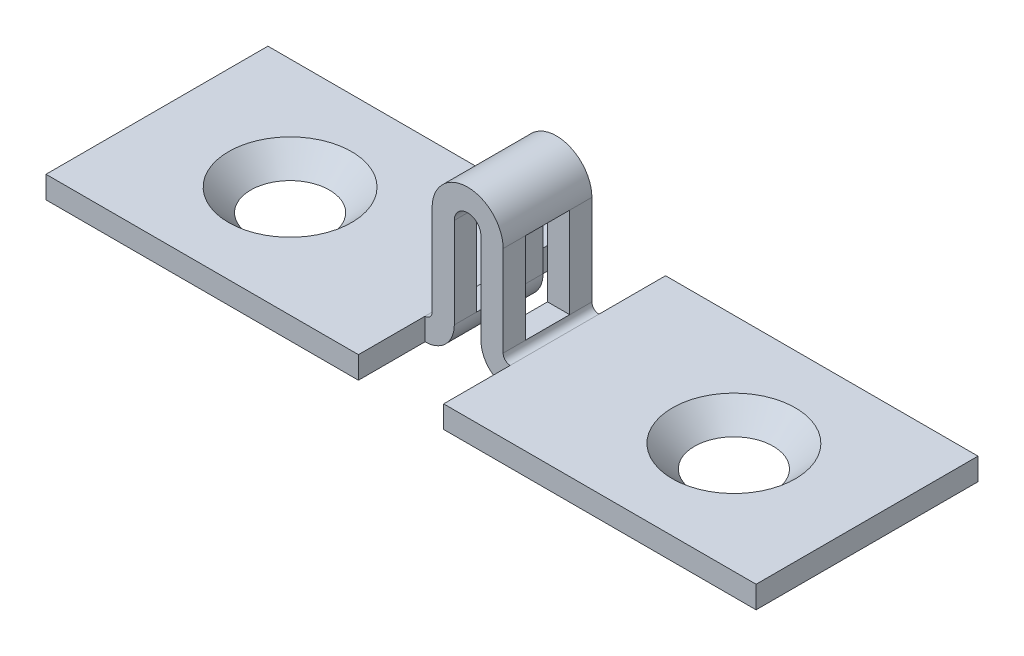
from build123d import *

# Parameters (mm, degrees)
EXTRUDE_THIN1_DEPTH                            = 3.96875
SKETCH2_W                                      = 3.048
SKETCH2_H                                      = 2.38125
EXTRUDE1_DEPTH                                 = 15.419184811
CSK_FOR_M2_FLAT_HEAD_MACHINE_SCREW1_AT_2_COUNT = 2
CSK_FOR_M2_FLAT_HEAD_MACHINE_SCREW1_AT_2_PITCH = 15.875
EXTRUDE2_DEPTH                                 = 15.132316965
EXTRUDE2_DEPTH_BACK                            = 15.132316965
SKETCH5_W                                      = 1.5875
SKETCH5_H                                      = 3.2385


with BuildPart() as part:
    # Sketch1 → Extrude-Thin1 (new, symmetric)
    with BuildSketch(Plane.XY):
        with BuildLine():
            Line((12.7, 0), (1.524, 0))
            ThreePointArc((1.524, 0), (1.344394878, 0.074394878), (1.27, 0.254))
            Line((1.27, 0.254), (1.27, 3.4925))
            ThreePointArc((1.27, 3.4925), (0, 4.7625), (-1.27, 3.4925))
            Line((-1.27, 3.4925), (-1.27, 0.254))
            ThreePointArc((-1.27, 0.254), (-1.344394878, 0.074394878), (-1.524, 0))
            Line((-1.524, 0), (-12.7, 0))
            Line((-12.7, 0), (-12.7, -0.79375))
            Line((-12.7, -0.79375), (-1.524, -0.79375))
            ThreePointArc((-1.524, -0.79375), (-0.78312887, -0.48687113), (-0.47625, 0.254))
            Line((-0.47625, 0.254), (-0.47625, 3.4925))
            ThreePointArc((-0.47625, 3.4925), (0, 3.96875), (0.47625, 3.4925))
            Line((0.47625, 3.4925), (0.47625, 0.254))
            ThreePointArc((0.47625, 0.254), (0.78312887, -0.48687113), (1.524, -0.79375))
            Line((1.524, -0.79375), (12.7, -0.79375))
            Line((12.7, -0.79375), (12.7, 0))
        make_face()
    extrude(amount=EXTRUDE_THIN1_DEPTH, both=True)

    # Sketch2 → Extrude1 (cut, through all)
    with BuildSketch(Plane.XZ.offset(0.79375)):
        with Locations((0, 2.778125)):
            Rectangle(SKETCH2_W, SKETCH2_H)
        with Locations((0, -2.778125)):
            Rectangle(SKETCH2_W, SKETCH2_H)
    extrude(amount=-EXTRUDE1_DEPTH, mode=Mode.SUBTRACT)

    # Sketch3 → CSK for M2 Flat Head Machine Screw1 (revolve, cut)
    with BuildSketch(Plane(origin=(7.9375, 0, 0), x_dir=(0, 0, 1), z_dir=(1, 0, 0))):
        Polygon((0, 0), (0, 0.79375), (1.2, 0.79375), (1.2, 1), (2.2, 0), align=None)
    csk_for_m2_flat_head_machine_screw1 = revolve(axis=Axis((7.9375, 6.35, 0), (0, -1, 0)), mode=Mode.SUBTRACT)

    # CSK for M2 Flat Head Machine Screw1 at 2: CSK for M2 Flat Head Machine Screw1 ×2
    with Locations(*[(-i * CSK_FOR_M2_FLAT_HEAD_MACHINE_SCREW1_AT_2_PITCH, 0, 0) for i in range(1, CSK_FOR_M2_FLAT_HEAD_MACHINE_SCREW1_AT_2_COUNT)]):
        add(csk_for_m2_flat_head_machine_screw1, mode=Mode.SUBTRACT)

    # Sketch5 → Extrude2 (cut, two sides: drawn at the far end of the back side and taken through both)
    with BuildSketch(Plane(origin=(0, 0, 0), x_dir=(0, 0, -1), z_dir=(1, 0, 0)).offset(-EXTRUDE2_DEPTH_BACK)):
        with Locations((0, 1.87325)):
            Rectangle(SKETCH5_W, SKETCH5_H)
    extrude(amount=EXTRUDE2_DEPTH + EXTRUDE2_DEPTH_BACK, mode=Mode.SUBTRACT)


solid = part.part
